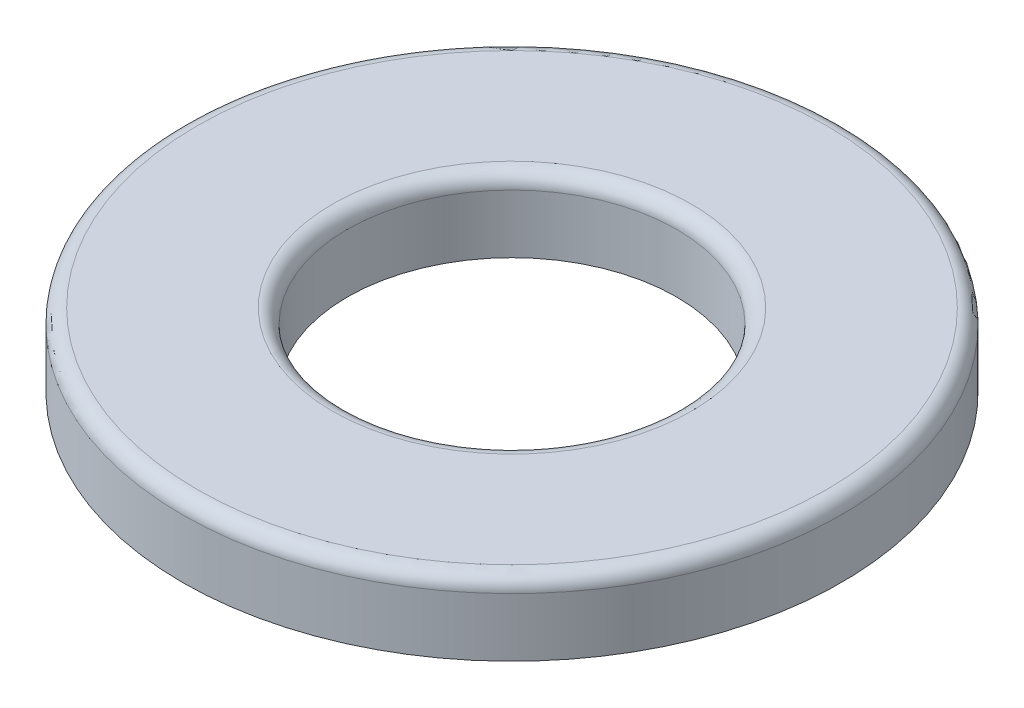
from build123d import *

# Parameters (mm, degrees)
SKETCH_1_R      = 4.5
SKETCH_1_R_2    = 2.25
EXTRUDE_1_DEPTH = 0.5
FILLET_1_R      = 0.2


with BuildPart() as part:
    # Sketch 1 → Extrude 1 (new, symmetric)
    with BuildSketch(Plane(origin=(0, 0, 0), x_dir=(1, 0, 0), z_dir=(0, 1, 0))):
        with Locations(Location((0, 0, 0), (0, 0, 270))):
            Circle(SKETCH_1_R)
        with Locations(Location((0, 0, 0), (0, 0, 270))):
            Circle(SKETCH_1_R_2, mode=Mode.SUBTRACT)
    extrude(amount=EXTRUDE_1_DEPTH, both=True)

    # Fillet 1
    fillet_1_edges = [part.edges().sort_by_distance(p)[0] for p in [
        (0, 0.5, -4.5),
        (0, 0.5, -2.25),
    ]]
    fillet(fillet_1_edges, radius=FILLET_1_R)


solid = part.part
